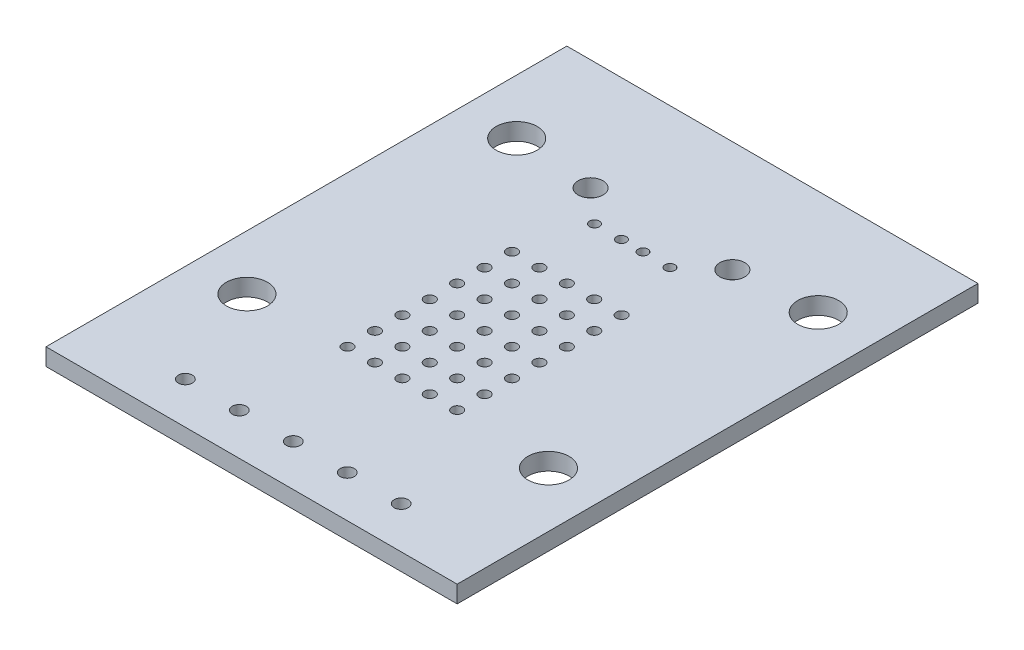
from build123d import *

# Parameters (mm, degrees)
SKETCH1_W           = 38.1
SKETCH1_H           = 48.26
BOSS_EXTRUDE1_DEPTH = 1.5875
SKETCH2_R           = 1.905
SKETCH2_R_2         = 0.65
CUT_EXTRUDE1_DEPTH  = 52.908094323
SKETCH3_R           = 0.4953
CUT_EXTRUDE2_DEPTH  = 52.908094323
SKETCH4_R           = 1.15
SKETCH4_R_2         = 0.4572
CUT_EXTRUDE3_DEPTH  = 52.908094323


with BuildPart() as part:
    # Sketch1 → Boss-Extrude1 (new body)
    with BuildSketch(Plane(origin=(0, 0, 0), x_dir=(1, 0, 0), z_dir=(0, 1, 0))):
        with Locations((0, 24.13)):
            Rectangle(SKETCH1_W, SKETCH1_H)
    extrude(amount=BOSS_EXTRUDE1_DEPTH)

    # Sketch2 (on Top Plane) → Cut-Extrude1 (cut, through all)
    with BuildSketch(Plane(origin=(0, 0, 0), x_dir=(1, 0, 0), z_dir=(0, 1, 0))):
        with Locations(Location((-13.97, 13.5382, 0), (0, 0, 270))):
            Circle(SKETCH2_R)
        with Locations(Location((-13.97, 38.53434, 0), (0, 0, 270))):
            Circle(SKETCH2_R)
        with Locations(Location((-9.99998, 3.86334, 0), (0, 0, 270))):
            Circle(SKETCH2_R_2)
        with Locations(Location((-5.00126, 3.86334, 0), (0, 0, 270))):
            Circle(SKETCH2_R_2)
        with Locations(Location((0, 3.86334, 0), (0, 0, 270))):
            Circle(SKETCH2_R_2)
        with Locations(Location((13.97, 38.53434, 0), (0, 0, 90))):
            Circle(SKETCH2_R)
        with Locations(Location((13.97, 13.5382, 0), (0, 0, 90))):
            Circle(SKETCH2_R)
        with Locations(Location((5.00126, 3.86334, 0), (0, 0, 90))):
            Circle(SKETCH2_R_2)
        with Locations(Location((9.99998, 3.86334, 0), (0, 0, 90))):
            Circle(SKETCH2_R_2)
    extrude(amount=CUT_EXTRUDE1_DEPTH, mode=Mode.SUBTRACT)

    # Sketch3 → Cut-Extrude2 (cut, through all)
    with BuildSketch(Plane(origin=(0, 1.5875, 0), x_dir=(1, 0, 0), z_dir=(0, 1, 0))):
        with Locations(Location((-5.08, 13.97, 0), (0, 0, 270))):
            Circle(SKETCH3_R)
        with Locations(Location((-2.54, 13.97, 0), (0, 0, 270))):
            Circle(SKETCH3_R)
        with Locations(Location((0, 13.97, 0), (0, 0, 270))):
            Circle(SKETCH3_R)
        with Locations(Location((2.54, 13.97, 0), (0, 0, 270))):
            Circle(SKETCH3_R)
        with Locations(Location((5.08, 13.97, 0), (0, 0, 270))):
            Circle(SKETCH3_R)
        with Locations(Location((-2.54, 16.51, 0), (0, 0, 270))):
            Circle(SKETCH3_R)
        with Locations(Location((0, 16.51, 0), (0, 0, 270))):
            Circle(SKETCH3_R)
        with Locations(Location((2.54, 16.51, 0), (0, 0, 270))):
            Circle(SKETCH3_R)
        with Locations(Location((5.08, 16.51, 0), (0, 0, 270))):
            Circle(SKETCH3_R)
        with Locations(Location((-2.54, 19.05, 0), (0, 0, 270))):
            Circle(SKETCH3_R)
        with Locations(Location((0, 19.05, 0), (0, 0, 270))):
            Circle(SKETCH3_R)
        with Locations(Location((2.54, 19.05, 0), (0, 0, 270))):
            Circle(SKETCH3_R)
        with Locations(Location((5.08, 19.05, 0), (0, 0, 270))):
            Circle(SKETCH3_R)
        with Locations(Location((-2.54, 21.59, 0), (0, 0, 270))):
            Circle(SKETCH3_R)
        with Locations(Location((0, 21.59, 0), (0, 0, 270))):
            Circle(SKETCH3_R)
        with Locations(Location((2.54, 21.59, 0), (0, 0, 270))):
            Circle(SKETCH3_R)
        with Locations(Location((5.08, 21.59, 0), (0, 0, 270))):
            Circle(SKETCH3_R)
        with Locations(Location((-2.54, 24.13, 0), (0, 0, 270))):
            Circle(SKETCH3_R)
        with Locations(Location((0, 24.13, 0), (0, 0, 270))):
            Circle(SKETCH3_R)
        with Locations(Location((2.54, 24.13, 0), (0, 0, 270))):
            Circle(SKETCH3_R)
        with Locations(Location((5.08, 24.13, 0), (0, 0, 270))):
            Circle(SKETCH3_R)
        with Locations(Location((-2.54, 26.67, 0), (0, 0, 270))):
            Circle(SKETCH3_R)
        with Locations(Location((0, 26.67, 0), (0, 0, 270))):
            Circle(SKETCH3_R)
        with Locations(Location((2.54, 26.67, 0), (0, 0, 270))):
            Circle(SKETCH3_R)
        with Locations(Location((5.08, 26.67, 0), (0, 0, 270))):
            Circle(SKETCH3_R)
        with Locations(Location((-2.54, 29.21, 0), (0, 0, 270))):
            Circle(SKETCH3_R)
        with Locations(Location((0, 29.21, 0), (0, 0, 270))):
            Circle(SKETCH3_R)
        with Locations(Location((2.54, 29.21, 0), (0, 0, 270))):
            Circle(SKETCH3_R)
        with Locations(Location((5.08, 29.21, 0), (0, 0, 270))):
            Circle(SKETCH3_R)
        with Locations(Location((-5.08, 16.51, 0), (0, 0, 270))):
            Circle(SKETCH3_R)
        with Locations(Location((-5.08, 19.05, 0), (0, 0, 270))):
            Circle(SKETCH3_R)
        with Locations(Location((-5.08, 21.59, 0), (0, 0, 270))):
            Circle(SKETCH3_R)
        with Locations(Location((-5.08, 24.13, 0), (0, 0, 270))):
            Circle(SKETCH3_R)
        with Locations(Location((-5.08, 26.67, 0), (0, 0, 270))):
            Circle(SKETCH3_R)
        with Locations(Location((-5.08, 29.21, 0), (0, 0, 270))):
            Circle(SKETCH3_R)
    extrude(amount=-CUT_EXTRUDE2_DEPTH, mode=Mode.SUBTRACT)

    # Sketch4 → Cut-Extrude3 (cut, through all)
    with BuildSketch(Plane(origin=(0, 1.5875, 0), x_dir=(1, 0, 0), z_dir=(0, 1, 0))):
        with Locations(Location((-6.57098, 37.98062, 0), (0, 0, 270))):
            Circle(SKETCH4_R)
        with Locations(Location((-3.50012, 35.27044, 0), (0, 0, 270))):
            Circle(SKETCH4_R_2)
        with Locations(Location((-1.00076, 35.27044, 0), (0, 0, 270))):
            Circle(SKETCH4_R_2)
        with Locations(Location((6.57098, 37.98062, 0), (0, 0, 90))):
            Circle(SKETCH4_R)
        with Locations(Location((1.00076, 35.27044, 0), (0, 0, 90))):
            Circle(SKETCH4_R_2)
        with Locations(Location((3.50012, 35.27044, 0), (0, 0, 90))):
            Circle(SKETCH4_R_2)
    extrude(amount=-CUT_EXTRUDE3_DEPTH, mode=Mode.SUBTRACT)


solid = part.part
